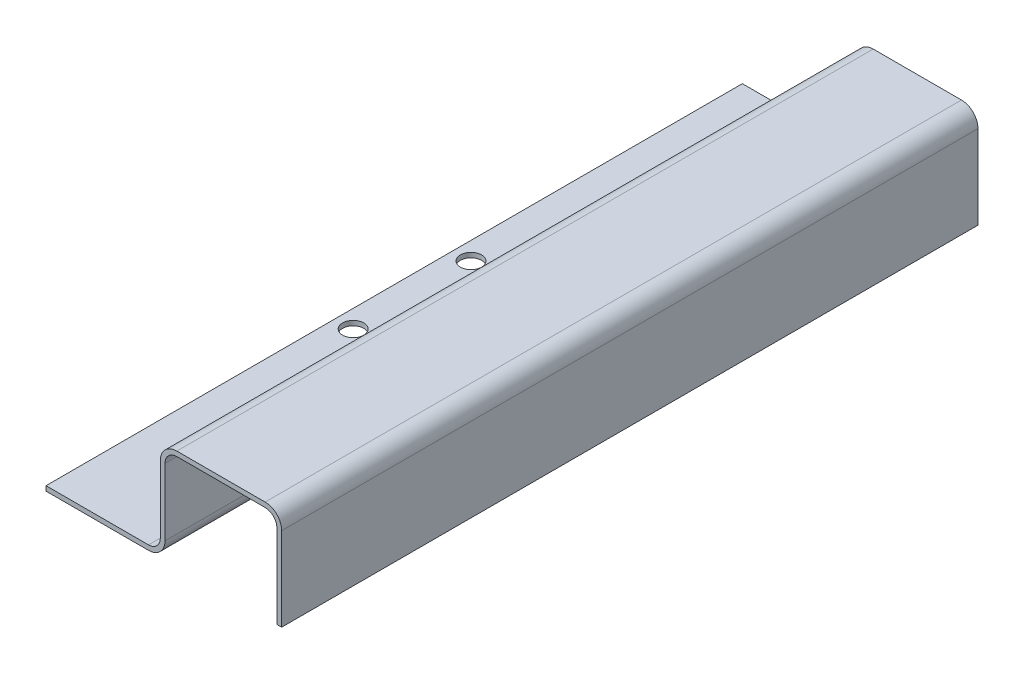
ISO-10303-21;
HEADER;
FILE_DESCRIPTION(('STEP AP214'),'2;1');
FILE_NAME('part.step','',(''),(''),'','','');
FILE_SCHEMA(('AUTOMOTIVE_DESIGN { 1 0 10303 214 1 1 1 1 }'));
ENDSEC;
DATA;
#1=APPLICATION_CONTEXT('core data for automotive mechanical design processes');
#2=APPLICATION_PROTOCOL_DEFINITION('international standard','automotive_design',2000,#1);
#3=PRODUCT_CONTEXT('',#1,'mechanical');
#4=PRODUCT('Part','Part','',(#3));
#5=PRODUCT_RELATED_PRODUCT_CATEGORY('part','',(#4));
#6=PRODUCT_DEFINITION_FORMATION('','',#4);
#7=PRODUCT_DEFINITION_CONTEXT('part definition',#1,'design');
#8=PRODUCT_DEFINITION('design','',#6,#7);
#9=PRODUCT_DEFINITION_SHAPE('','',#8);
#10=(LENGTH_UNIT() NAMED_UNIT(*) SI_UNIT(.MILLI.,.METRE.));
#11=(NAMED_UNIT(*) PLANE_ANGLE_UNIT() SI_UNIT($,.RADIAN.));
#12=(NAMED_UNIT(*) SI_UNIT($,.STERADIAN.) SOLID_ANGLE_UNIT());
#13=UNCERTAINTY_MEASURE_WITH_UNIT(LENGTH_MEASURE(1.E-05),#10,'distance_accuracy_value','');
#14=(GEOMETRIC_REPRESENTATION_CONTEXT(3) GLOBAL_UNCERTAINTY_ASSIGNED_CONTEXT((#13)) GLOBAL_UNIT_ASSIGNED_CONTEXT((#10,
#11,#12)) REPRESENTATION_CONTEXT('',''));
#15=CARTESIAN_POINT('',(0.,0.,0.));
#16=DIRECTION('',(0.,0.,1.));
#17=DIRECTION('',(1.,0.,0.));
#18=AXIS2_PLACEMENT_3D('',#15,#16,#17);
#19=CARTESIAN_POINT('',(47.23638,17.00276,75.057));
#20=DIRECTION('',(0.,0.,-1.));
#21=DIRECTION('',(-1.,0.,0.));
#22=AXIS2_PLACEMENT_3D('',#19,#20,#21);
#23=CYLINDRICAL_SURFACE('',#22,2.54);
#24=CARTESIAN_POINT('',(47.23638,17.00276,-75.057));
#25=DIRECTION('',(0.,0.,-1.));
#26=DIRECTION('',(1.,0.,0.));
#27=AXIS2_PLACEMENT_3D('',#24,#25,#26);
#28=CIRCLE('',#27,2.54);
#29=CARTESIAN_POINT('',(47.23638,19.54276,-75.057));
#30=VERTEX_POINT('',#29);
#31=CARTESIAN_POINT('',(49.77638,17.00276,-75.057));
#32=VERTEX_POINT('',#31);
#33=EDGE_CURVE('E179',#30,#32,#28,.T.);
#34=ORIENTED_EDGE('',*,*,#33,.T.);
#35=DIRECTION('',(0.,0.,-1.));
#36=VECTOR('',#35,1.);
#37=CARTESIAN_POINT('',(49.77638,17.00276,75.057));
#38=LINE('',#37,#36);
#39=CARTESIAN_POINT('',(49.77638,17.00276,75.057));
#40=VERTEX_POINT('',#39);
#41=EDGE_CURVE('E11',#40,#32,#38,.T.);
#42=ORIENTED_EDGE('',*,*,#41,.F.);
#43=CARTESIAN_POINT('',(47.23638,17.00276,75.057));
#44=DIRECTION('',(0.,0.,-1.));
#45=DIRECTION('',(1.,0.,0.));
#46=AXIS2_PLACEMENT_3D('',#43,#44,#45);
#47=CIRCLE('',#46,2.54);
#48=CARTESIAN_POINT('',(47.23638,19.54276,75.057));
#49=VERTEX_POINT('',#48);
#50=EDGE_CURVE('E210',#49,#40,#47,.T.);
#51=ORIENTED_EDGE('',*,*,#50,.F.);
#52=DIRECTION('',(0.,0.,-1.));
#53=VECTOR('',#52,1.);
#54=CARTESIAN_POINT('',(47.23638,19.54276,75.057));
#55=LINE('',#54,#53);
#56=EDGE_CURVE('E175',#49,#30,#55,.T.);
#57=ORIENTED_EDGE('',*,*,#56,.T.);
#58=EDGE_LOOP('',(#34,#42,#51,#57));
#59=FACE_BOUND('',#58,.T.);
#60=ADVANCED_FACE('F35',(#59),#23,.F.);
#61=CARTESIAN_POINT('',(49.77638,17.00276,75.057));
#62=DIRECTION('',(1.,0.,0.));
#63=DIRECTION('',(0.,1.,0.));
#64=AXIS2_PLACEMENT_3D('',#61,#62,#63);
#65=PLANE('',#64);
#66=DIRECTION('',(0.,-1.,0.));
#67=VECTOR('',#66,1.);
#68=CARTESIAN_POINT('',(49.77638,17.00276,-75.057));
#69=LINE('',#68,#67);
#70=CARTESIAN_POINT('',(49.77638,-1.02362,-75.057));
#71=VERTEX_POINT('',#70);
#72=EDGE_CURVE('E182',#32,#71,#69,.T.);
#73=ORIENTED_EDGE('',*,*,#72,.T.);
#74=DIRECTION('',(0.,0.,-1.));
#75=VECTOR('',#74,1.);
#76=CARTESIAN_POINT('',(49.77638,-1.02362,75.057));
#77=LINE('',#76,#75);
#78=CARTESIAN_POINT('',(49.77638,-1.02362,75.057));
#79=VERTEX_POINT('',#78);
#80=EDGE_CURVE('E43',#79,#71,#77,.T.);
#81=ORIENTED_EDGE('',*,*,#80,.F.);
#82=DIRECTION('',(0.,-1.,0.));
#83=VECTOR('',#82,1.);
#84=CARTESIAN_POINT('',(49.77638,17.00276,75.057));
#85=LINE('',#84,#83);
#86=EDGE_CURVE('E118',#40,#79,#85,.T.);
#87=ORIENTED_EDGE('',*,*,#86,.F.);
#88=ORIENTED_EDGE('',*,*,#41,.T.);
#89=EDGE_LOOP('',(#73,#81,#87,#88));
#90=FACE_BOUND('',#89,.T.);
#91=ADVANCED_FACE('F308',(#90),#65,.F.);
#92=CARTESIAN_POINT('',(49.77638,-1.02362,75.057));
#93=DIRECTION('',(0.,1.,0.));
#94=DIRECTION('',(0.,0.,1.));
#95=AXIS2_PLACEMENT_3D('',#92,#93,#94);
#96=PLANE('',#95);
#97=DIRECTION('',(1.,0.,0.));
#98=VECTOR('',#97,1.);
#99=CARTESIAN_POINT('',(49.77638,-1.02362,-75.057));
#100=LINE('',#99,#98);
#101=CARTESIAN_POINT('',(50.8,-1.02362,-75.057));
#102=VERTEX_POINT('',#101);
#103=EDGE_CURVE('E185',#71,#102,#100,.T.);
#104=ORIENTED_EDGE('',*,*,#103,.T.);
#105=DIRECTION('',(0.,0.,-1.));
#106=VECTOR('',#105,1.);
#107=CARTESIAN_POINT('',(50.8,-1.02362,75.057));
#108=LINE('',#107,#106);
#109=CARTESIAN_POINT('',(50.8,-1.02362,75.057));
#110=VERTEX_POINT('',#109);
#111=EDGE_CURVE('E241',#110,#102,#108,.T.);
#112=ORIENTED_EDGE('',*,*,#111,.F.);
#113=DIRECTION('',(1.,0.,0.));
#114=VECTOR('',#113,1.);
#115=CARTESIAN_POINT('',(49.77638,-1.02362,75.057));
#116=LINE('',#115,#114);
#117=EDGE_CURVE('E249',#79,#110,#116,.T.);
#118=ORIENTED_EDGE('',*,*,#117,.F.);
#119=ORIENTED_EDGE('',*,*,#80,.T.);
#120=EDGE_LOOP('',(#104,#112,#118,#119));
#121=FACE_BOUND('',#120,.T.);
#122=ADVANCED_FACE('F247',(#121),#96,.F.);
#123=CARTESIAN_POINT('',(50.8,17.00276,75.057));
#124=DIRECTION('',(-1.,0.,0.));
#125=DIRECTION('',(0.,-1.,0.));
#126=AXIS2_PLACEMENT_3D('',#123,#124,#125);
#127=PLANE('',#126);
#128=DIRECTION('',(0.,1.,0.));
#129=VECTOR('',#128,1.);
#130=CARTESIAN_POINT('',(50.8,17.00276,-75.057));
#131=LINE('',#130,#129);
#132=CARTESIAN_POINT('',(50.8,17.00276,-75.057));
#133=VERTEX_POINT('',#132);
#134=EDGE_CURVE('E187',#102,#133,#131,.T.);
#135=ORIENTED_EDGE('',*,*,#134,.T.);
#136=DIRECTION('',(0.,0.,-1.));
#137=VECTOR('',#136,1.);
#138=CARTESIAN_POINT('',(50.8,17.00276,75.057));
#139=LINE('',#138,#137);
#140=CARTESIAN_POINT('',(50.8,17.00276,75.057));
#141=VERTEX_POINT('',#140);
#142=EDGE_CURVE('E238',#141,#133,#139,.T.);
#143=ORIENTED_EDGE('',*,*,#142,.F.);
#144=DIRECTION('',(0.,1.,0.));
#145=VECTOR('',#144,1.);
#146=CARTESIAN_POINT('',(50.8,17.00276,75.057));
#147=LINE('',#146,#145);
#148=EDGE_CURVE('E267',#110,#141,#147,.T.);
#149=ORIENTED_EDGE('',*,*,#148,.F.);
#150=ORIENTED_EDGE('',*,*,#111,.T.);
#151=EDGE_LOOP('',(#135,#143,#149,#150));
#152=FACE_BOUND('',#151,.T.);
#153=ADVANCED_FACE('F258',(#152),#127,.F.);
#154=CARTESIAN_POINT('',(47.23638,17.00276,75.057));
#155=DIRECTION('',(0.,0.,-1.));
#156=DIRECTION('',(-1.,0.,0.));
#157=AXIS2_PLACEMENT_3D('',#154,#155,#156);
#158=CYLINDRICAL_SURFACE('',#157,3.56362);
#159=CARTESIAN_POINT('',(47.23638,17.00276,-75.057));
#160=DIRECTION('',(0.,0.,1.));
#161=DIRECTION('',(1.,0.,0.));
#162=AXIS2_PLACEMENT_3D('',#159,#160,#161);
#163=CIRCLE('',#162,3.56362);
#164=CARTESIAN_POINT('',(47.23638,20.56638,-75.057));
#165=VERTEX_POINT('',#164);
#166=EDGE_CURVE('E189',#133,#165,#163,.T.);
#167=ORIENTED_EDGE('',*,*,#166,.T.);
#168=DIRECTION('',(0.,0.,-1.));
#169=VECTOR('',#168,1.);
#170=CARTESIAN_POINT('',(47.23638,20.56638,75.057));
#171=LINE('',#170,#169);
#172=CARTESIAN_POINT('',(47.23638,20.56638,75.057));
#173=VERTEX_POINT('',#172);
#174=EDGE_CURVE('E235',#173,#165,#171,.T.);
#175=ORIENTED_EDGE('',*,*,#174,.F.);
#176=CARTESIAN_POINT('',(47.23638,17.00276,75.057));
#177=DIRECTION('',(0.,0.,1.));
#178=DIRECTION('',(1.,0.,0.));
#179=AXIS2_PLACEMENT_3D('',#176,#177,#178);
#180=CIRCLE('',#179,3.56362);
#181=EDGE_CURVE('E264',#141,#173,#180,.T.);
#182=ORIENTED_EDGE('',*,*,#181,.F.);
#183=ORIENTED_EDGE('',*,*,#142,.T.);
#184=EDGE_LOOP('',(#167,#175,#182,#183));
#185=FACE_BOUND('',#184,.T.);
#186=ADVANCED_FACE('F262',(#185),#158,.T.);
#187=CARTESIAN_POINT('',(28.20162,20.56638,75.057));
#188=DIRECTION('',(0.,-1.,0.));
#189=DIRECTION('',(0.,0.,-1.));
#190=AXIS2_PLACEMENT_3D('',#187,#188,#189);
#191=PLANE('',#190);
#192=DIRECTION('',(-1.,0.,0.));
#193=VECTOR('',#192,1.);
#194=CARTESIAN_POINT('',(28.20162,20.56638,-75.057));
#195=LINE('',#194,#193);
#196=CARTESIAN_POINT('',(28.20162,20.56638,-75.057));
#197=VERTEX_POINT('',#196);
#198=EDGE_CURVE('E191',#165,#197,#195,.T.);
#199=ORIENTED_EDGE('',*,*,#198,.T.);
#200=DIRECTION('',(0.,0.,-1.));
#201=VECTOR('',#200,1.);
#202=CARTESIAN_POINT('',(28.20162,20.56638,75.057));
#203=LINE('',#202,#201);
#204=CARTESIAN_POINT('',(28.20162,20.56638,75.057));
#205=VERTEX_POINT('',#204);
#206=EDGE_CURVE('E232',#205,#197,#203,.T.);
#207=ORIENTED_EDGE('',*,*,#206,.F.);
#208=DIRECTION('',(-1.,0.,0.));
#209=VECTOR('',#208,1.);
#210=CARTESIAN_POINT('',(28.20162,20.56638,75.057));
#211=LINE('',#210,#209);
#212=EDGE_CURVE('E266',#173,#205,#211,.T.);
#213=ORIENTED_EDGE('',*,*,#212,.F.);
#214=ORIENTED_EDGE('',*,*,#174,.T.);
#215=EDGE_LOOP('',(#199,#207,#213,#214));
#216=FACE_BOUND('',#215,.T.);
#217=ADVANCED_FACE('F321',(#216),#191,.F.);
#218=CARTESIAN_POINT('',(28.20162,17.00276,75.057));
#219=DIRECTION('',(0.,0.,-1.));
#220=DIRECTION('',(-1.,0.,0.));
#221=AXIS2_PLACEMENT_3D('',#218,#219,#220);
#222=CYLINDRICAL_SURFACE('',#221,3.56362);
#223=CARTESIAN_POINT('',(28.20162,17.00276,-75.057));
#224=DIRECTION('',(0.,0.,1.));
#225=DIRECTION('',(1.,0.,0.));
#226=AXIS2_PLACEMENT_3D('',#223,#224,#225);
#227=CIRCLE('',#226,3.56362);
#228=CARTESIAN_POINT('',(24.638,17.00276,-75.057));
#229=VERTEX_POINT('',#228);
#230=EDGE_CURVE('E193',#197,#229,#227,.T.);
#231=ORIENTED_EDGE('',*,*,#230,.T.);
#232=DIRECTION('',(0.,0.,-1.));
#233=VECTOR('',#232,1.);
#234=CARTESIAN_POINT('',(24.638,17.00276,75.057));
#235=LINE('',#234,#233);
#236=CARTESIAN_POINT('',(24.638,17.00276,75.057));
#237=VERTEX_POINT('',#236);
#238=EDGE_CURVE('E229',#237,#229,#235,.T.);
#239=ORIENTED_EDGE('',*,*,#238,.F.);
#240=CARTESIAN_POINT('',(28.20162,17.00276,75.057));
#241=DIRECTION('',(0.,0.,1.));
#242=DIRECTION('',(1.,0.,0.));
#243=AXIS2_PLACEMENT_3D('',#240,#241,#242);
#244=CIRCLE('',#243,3.56362);
#245=EDGE_CURVE('E269',#205,#237,#244,.T.);
#246=ORIENTED_EDGE('',*,*,#245,.F.);
#247=ORIENTED_EDGE('',*,*,#206,.T.);
#248=EDGE_LOOP('',(#231,#239,#246,#247));
#249=FACE_BOUND('',#248,.T.);
#250=ADVANCED_FACE('F324',(#249),#222,.T.);
#251=CARTESIAN_POINT('',(24.638,2.54,75.057));
#252=DIRECTION('',(1.,0.,0.));
#253=DIRECTION('',(0.,1.,0.));
#254=AXIS2_PLACEMENT_3D('',#251,#252,#253);
#255=PLANE('',#254);
#256=DIRECTION('',(0.,-1.,0.));
#257=VECTOR('',#256,1.);
#258=CARTESIAN_POINT('',(24.638,2.54,-75.057));
#259=LINE('',#258,#257);
#260=CARTESIAN_POINT('',(24.638,2.54,-75.057));
#261=VERTEX_POINT('',#260);
#262=EDGE_CURVE('E195',#229,#261,#259,.T.);
#263=ORIENTED_EDGE('',*,*,#262,.T.);
#264=DIRECTION('',(0.,0.,-1.));
#265=VECTOR('',#264,1.);
#266=CARTESIAN_POINT('',(24.638,2.54,75.057));
#267=LINE('',#266,#265);
#268=CARTESIAN_POINT('',(24.638,2.54,75.057));
#269=VERTEX_POINT('',#268);
#270=EDGE_CURVE('E226',#269,#261,#267,.T.);
#271=ORIENTED_EDGE('',*,*,#270,.F.);
#272=DIRECTION('',(0.,-1.,0.));
#273=VECTOR('',#272,1.);
#274=CARTESIAN_POINT('',(24.638,2.54,75.057));
#275=LINE('',#274,#273);
#276=EDGE_CURVE('E275',#237,#269,#275,.T.);
#277=ORIENTED_EDGE('',*,*,#276,.F.);
#278=ORIENTED_EDGE('',*,*,#238,.T.);
#279=EDGE_LOOP('',(#263,#271,#277,#278));
#280=FACE_BOUND('',#279,.T.);
#281=ADVANCED_FACE('F328',(#280),#255,.F.);
#282=CARTESIAN_POINT('',(22.098,2.54,75.057));
#283=DIRECTION('',(0.,0.,-1.));
#284=DIRECTION('',(-1.,0.,0.));
#285=AXIS2_PLACEMENT_3D('',#282,#283,#284);
#286=CYLINDRICAL_SURFACE('',#285,2.54);
#287=CARTESIAN_POINT('',(22.098,2.54,-75.057));
#288=DIRECTION('',(0.,0.,-1.));
#289=DIRECTION('',(1.,0.,0.));
#290=AXIS2_PLACEMENT_3D('',#287,#288,#289);
#291=CIRCLE('',#290,2.54);
#292=CARTESIAN_POINT('',(22.098,0.,-75.057));
#293=VERTEX_POINT('',#292);
#294=EDGE_CURVE('E197',#261,#293,#291,.T.);
#295=ORIENTED_EDGE('',*,*,#294,.T.);
#296=DIRECTION('',(0.,0.,-1.));
#297=VECTOR('',#296,1.);
#298=CARTESIAN_POINT('',(22.098,0.,75.057));
#299=LINE('',#298,#297);
#300=CARTESIAN_POINT('',(22.098,0.,75.057));
#301=VERTEX_POINT('',#300);
#302=EDGE_CURVE('E223',#301,#293,#299,.T.);
#303=ORIENTED_EDGE('',*,*,#302,.F.);
#304=CARTESIAN_POINT('',(22.098,2.54,75.057));
#305=DIRECTION('',(0.,0.,-1.));
#306=DIRECTION('',(1.,0.,0.));
#307=AXIS2_PLACEMENT_3D('',#304,#305,#306);
#308=CIRCLE('',#307,2.54);
#309=EDGE_CURVE('E277',#269,#301,#308,.T.);
#310=ORIENTED_EDGE('',*,*,#309,.F.);
#311=ORIENTED_EDGE('',*,*,#270,.T.);
#312=EDGE_LOOP('',(#295,#303,#310,#311));
#313=FACE_BOUND('',#312,.T.);
#314=ADVANCED_FACE('F332',(#313),#286,.F.);
#315=CARTESIAN_POINT('',(0.,0.,75.057));
#316=DIRECTION('',(0.,-1.,0.));
#317=DIRECTION('',(0.,0.,-1.));
#318=AXIS2_PLACEMENT_3D('',#315,#316,#317);
#319=PLANE('',#318);
#320=CARTESIAN_POINT('',(3.8608,0.,12.7));
#321=DIRECTION('',(0.,1.,0.));
#322=DIRECTION('',(0.,0.,1.));
#323=AXIS2_PLACEMENT_3D('',#320,#321,#322);
#324=CIRCLE('',#323,2.286);
#325=CARTESIAN_POINT('',(3.8608,0.,14.986));
#326=VERTEX_POINT('',#325);
#327=EDGE_CURVE('E421',#326,#326,#324,.T.);
#328=ORIENTED_EDGE('',*,*,#327,.F.);
#329=EDGE_LOOP('',(#328));
#330=FACE_BOUND('',#329,.T.);
#331=CARTESIAN_POINT('',(3.8608,0.,-12.7));
#332=DIRECTION('',(0.,1.,0.));
#333=DIRECTION('',(0.,0.,1.));
#334=AXIS2_PLACEMENT_3D('',#331,#332,#333);
#335=CIRCLE('',#334,2.286);
#336=CARTESIAN_POINT('',(3.8608,0.,-10.414));
#337=VERTEX_POINT('',#336);
#338=EDGE_CURVE('E423',#337,#337,#335,.T.);
#339=ORIENTED_EDGE('',*,*,#338,.F.);
#340=EDGE_LOOP('',(#339));
#341=FACE_BOUND('',#340,.T.);
#342=DIRECTION('',(-1.,0.,0.));
#343=VECTOR('',#342,1.);
#344=CARTESIAN_POINT('',(0.,0.,-75.057));
#345=LINE('',#344,#343);
#346=CARTESIAN_POINT('',(0.,0.,-75.057));
#347=VERTEX_POINT('',#346);
#348=EDGE_CURVE('E199',#293,#347,#345,.T.);
#349=ORIENTED_EDGE('',*,*,#348,.T.);
#350=DIRECTION('',(0.,0.,-1.));
#351=VECTOR('',#350,1.);
#352=CARTESIAN_POINT('',(0.,0.,75.057));
#353=LINE('',#352,#351);
#354=CARTESIAN_POINT('',(0.,0.,75.057));
#355=VERTEX_POINT('',#354);
#356=EDGE_CURVE('E220',#355,#347,#353,.T.);
#357=ORIENTED_EDGE('',*,*,#356,.F.);
#358=DIRECTION('',(-1.,0.,0.));
#359=VECTOR('',#358,1.);
#360=CARTESIAN_POINT('',(0.,0.,75.057));
#361=LINE('',#360,#359);
#362=EDGE_CURVE('E279',#301,#355,#361,.T.);
#363=ORIENTED_EDGE('',*,*,#362,.F.);
#364=ORIENTED_EDGE('',*,*,#302,.T.);
#365=EDGE_LOOP('',(#349,#357,#363,#364));
#366=FACE_BOUND('',#365,.T.);
#367=ADVANCED_FACE('F336',(#330,#341,#366),#319,.F.);
#368=CARTESIAN_POINT('',(0.,0.,75.057));
#369=DIRECTION('',(1.,0.,0.));
#370=DIRECTION('',(0.,1.,0.));
#371=AXIS2_PLACEMENT_3D('',#368,#369,#370);
#372=PLANE('',#371);
#373=DIRECTION('',(0.,-1.,0.));
#374=VECTOR('',#373,1.);
#375=CARTESIAN_POINT('',(0.,0.,-75.057));
#376=LINE('',#375,#374);
#377=CARTESIAN_POINT('',(0.,-1.02362,-75.057));
#378=VERTEX_POINT('',#377);
#379=EDGE_CURVE('E201',#347,#378,#376,.T.);
#380=ORIENTED_EDGE('',*,*,#379,.T.);
#381=DIRECTION('',(0.,0.,-1.));
#382=VECTOR('',#381,1.);
#383=CARTESIAN_POINT('',(0.,-1.02362,75.057));
#384=LINE('',#383,#382);
#385=CARTESIAN_POINT('',(0.,-1.02362,75.057));
#386=VERTEX_POINT('',#385);
#387=EDGE_CURVE('E217',#386,#378,#384,.T.);
#388=ORIENTED_EDGE('',*,*,#387,.F.);
#389=DIRECTION('',(0.,-1.,0.));
#390=VECTOR('',#389,1.);
#391=CARTESIAN_POINT('',(0.,0.,75.057));
#392=LINE('',#391,#390);
#393=EDGE_CURVE('E281',#355,#386,#392,.T.);
#394=ORIENTED_EDGE('',*,*,#393,.F.);
#395=ORIENTED_EDGE('',*,*,#356,.T.);
#396=EDGE_LOOP('',(#380,#388,#394,#395));
#397=FACE_BOUND('',#396,.T.);
#398=ADVANCED_FACE('F340',(#397),#372,.F.);
#399=CARTESIAN_POINT('',(0.,-1.02362,75.057));
#400=DIRECTION('',(0.,1.,0.));
#401=DIRECTION('',(0.,0.,1.));
#402=AXIS2_PLACEMENT_3D('',#399,#400,#401);
#403=PLANE('',#402);
#404=CARTESIAN_POINT('',(3.8608,-1.02362,12.7));
#405=DIRECTION('',(0.,1.,0.));
#406=DIRECTION('',(0.,0.,1.));
#407=AXIS2_PLACEMENT_3D('',#404,#405,#406);
#408=CIRCLE('',#407,2.286);
#409=CARTESIAN_POINT('',(3.8608,-1.02362,14.986));
#410=VERTEX_POINT('',#409);
#411=EDGE_CURVE('E418',#410,#410,#408,.T.);
#412=ORIENTED_EDGE('',*,*,#411,.T.);
#413=EDGE_LOOP('',(#412));
#414=FACE_BOUND('',#413,.T.);
#415=CARTESIAN_POINT('',(3.8608,-1.02362,-12.7));
#416=DIRECTION('',(0.,1.,0.));
#417=DIRECTION('',(0.,0.,1.));
#418=AXIS2_PLACEMENT_3D('',#415,#416,#417);
#419=CIRCLE('',#418,2.286);
#420=CARTESIAN_POINT('',(3.8608,-1.02362,-10.414));
#421=VERTEX_POINT('',#420);
#422=EDGE_CURVE('E183',#421,#421,#419,.T.);
#423=ORIENTED_EDGE('',*,*,#422,.T.);
#424=EDGE_LOOP('',(#423));
#425=FACE_BOUND('',#424,.T.);
#426=DIRECTION('',(1.,0.,0.));
#427=VECTOR('',#426,1.);
#428=CARTESIAN_POINT('',(0.,-1.02362,-75.057));
#429=LINE('',#428,#427);
#430=CARTESIAN_POINT('',(22.098,-1.02362,-75.057));
#431=VERTEX_POINT('',#430);
#432=EDGE_CURVE('E203',#378,#431,#429,.T.);
#433=ORIENTED_EDGE('',*,*,#432,.T.);
#434=DIRECTION('',(0.,0.,-1.));
#435=VECTOR('',#434,1.);
#436=CARTESIAN_POINT('',(22.098,-1.02362,75.057));
#437=LINE('',#436,#435);
#438=CARTESIAN_POINT('',(22.098,-1.02362,75.057));
#439=VERTEX_POINT('',#438);
#440=EDGE_CURVE('E214',#439,#431,#437,.T.);
#441=ORIENTED_EDGE('',*,*,#440,.F.);
#442=DIRECTION('',(1.,0.,0.));
#443=VECTOR('',#442,1.);
#444=CARTESIAN_POINT('',(0.,-1.02362,75.057));
#445=LINE('',#444,#443);
#446=EDGE_CURVE('E283',#386,#439,#445,.T.);
#447=ORIENTED_EDGE('',*,*,#446,.F.);
#448=ORIENTED_EDGE('',*,*,#387,.T.);
#449=EDGE_LOOP('',(#433,#441,#447,#448));
#450=FACE_BOUND('',#449,.T.);
#451=ADVANCED_FACE('F289',(#414,#425,#450),#403,.F.);
#452=CARTESIAN_POINT('',(22.098,2.54,75.057));
#453=DIRECTION('',(0.,0.,-1.));
#454=DIRECTION('',(-1.,0.,0.));
#455=AXIS2_PLACEMENT_3D('',#452,#453,#454);
#456=CYLINDRICAL_SURFACE('',#455,3.56361999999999);
#457=CARTESIAN_POINT('',(22.098,2.54,-75.057));
#458=DIRECTION('',(0.,0.,1.));
#459=DIRECTION('',(1.,0.,0.));
#460=AXIS2_PLACEMENT_3D('',#457,#458,#459);
#461=CIRCLE('',#460,3.56361999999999);
#462=CARTESIAN_POINT('',(25.66162,2.54,-75.057));
#463=VERTEX_POINT('',#462);
#464=EDGE_CURVE('E205',#431,#463,#461,.T.);
#465=ORIENTED_EDGE('',*,*,#464,.T.);
#466=DIRECTION('',(0.,0.,-1.));
#467=VECTOR('',#466,1.);
#468=CARTESIAN_POINT('',(25.66162,2.54,75.057));
#469=LINE('',#468,#467);
#470=CARTESIAN_POINT('',(25.66162,2.54,75.057));
#471=VERTEX_POINT('',#470);
#472=EDGE_CURVE('E170',#471,#463,#469,.T.);
#473=ORIENTED_EDGE('',*,*,#472,.F.);
#474=CARTESIAN_POINT('',(22.098,2.54,75.057));
#475=DIRECTION('',(0.,0.,1.));
#476=DIRECTION('',(1.,0.,0.));
#477=AXIS2_PLACEMENT_3D('',#474,#475,#476);
#478=CIRCLE('',#477,3.56361999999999);
#479=EDGE_CURVE('E161',#439,#471,#478,.T.);
#480=ORIENTED_EDGE('',*,*,#479,.F.);
#481=ORIENTED_EDGE('',*,*,#440,.T.);
#482=EDGE_LOOP('',(#465,#473,#480,#481));
#483=FACE_BOUND('',#482,.T.);
#484=ADVANCED_FACE('F293',(#483),#456,.T.);
#485=CARTESIAN_POINT('',(25.66162,2.54,75.057));
#486=DIRECTION('',(-1.,0.,0.));
#487=DIRECTION('',(0.,-1.,0.));
#488=AXIS2_PLACEMENT_3D('',#485,#486,#487);
#489=PLANE('',#488);
#490=DIRECTION('',(0.,1.,0.));
#491=VECTOR('',#490,1.);
#492=CARTESIAN_POINT('',(25.66162,2.54,-75.057));
#493=LINE('',#492,#491);
#494=CARTESIAN_POINT('',(25.66162,17.00276,-75.057));
#495=VERTEX_POINT('',#494);
#496=EDGE_CURVE('E169',#463,#495,#493,.T.);
#497=ORIENTED_EDGE('',*,*,#496,.T.);
#498=DIRECTION('',(0.,0.,-1.));
#499=VECTOR('',#498,1.);
#500=CARTESIAN_POINT('',(25.66162,17.00276,75.057));
#501=LINE('',#500,#499);
#502=CARTESIAN_POINT('',(25.66162,17.00276,75.057));
#503=VERTEX_POINT('',#502);
#504=EDGE_CURVE('E166',#503,#495,#501,.T.);
#505=ORIENTED_EDGE('',*,*,#504,.F.);
#506=DIRECTION('',(0.,1.,0.));
#507=VECTOR('',#506,1.);
#508=CARTESIAN_POINT('',(25.66162,2.54,75.057));
#509=LINE('',#508,#507);
#510=EDGE_CURVE('E155',#471,#503,#509,.T.);
#511=ORIENTED_EDGE('',*,*,#510,.F.);
#512=ORIENTED_EDGE('',*,*,#472,.T.);
#513=EDGE_LOOP('',(#497,#505,#511,#512));
#514=FACE_BOUND('',#513,.T.);
#515=ADVANCED_FACE('F167',(#514),#489,.F.);
#516=CARTESIAN_POINT('',(28.20162,17.00276,75.057));
#517=DIRECTION('',(0.,0.,-1.));
#518=DIRECTION('',(-1.,0.,0.));
#519=AXIS2_PLACEMENT_3D('',#516,#517,#518);
#520=CYLINDRICAL_SURFACE('',#519,2.54);
#521=CARTESIAN_POINT('',(28.20162,17.00276,-75.057));
#522=DIRECTION('',(0.,0.,-1.));
#523=DIRECTION('',(1.,0.,0.));
#524=AXIS2_PLACEMENT_3D('',#521,#522,#523);
#525=CIRCLE('',#524,2.54);
#526=CARTESIAN_POINT('',(28.20162,19.54276,-75.057));
#527=VERTEX_POINT('',#526);
#528=EDGE_CURVE('E104',#495,#527,#525,.T.);
#529=ORIENTED_EDGE('',*,*,#528,.T.);
#530=DIRECTION('',(0.,0.,-1.));
#531=VECTOR('',#530,1.);
#532=CARTESIAN_POINT('',(28.20162,19.54276,75.057));
#533=LINE('',#532,#531);
#534=CARTESIAN_POINT('',(28.20162,19.54276,75.057));
#535=VERTEX_POINT('',#534);
#536=EDGE_CURVE('E171',#535,#527,#533,.T.);
#537=ORIENTED_EDGE('',*,*,#536,.F.);
#538=CARTESIAN_POINT('',(28.20162,17.00276,75.057));
#539=DIRECTION('',(0.,0.,-1.));
#540=DIRECTION('',(1.,0.,0.));
#541=AXIS2_PLACEMENT_3D('',#538,#539,#540);
#542=CIRCLE('',#541,2.54);
#543=EDGE_CURVE('E159',#503,#535,#542,.T.);
#544=ORIENTED_EDGE('',*,*,#543,.F.);
#545=ORIENTED_EDGE('',*,*,#504,.T.);
#546=EDGE_LOOP('',(#529,#537,#544,#545));
#547=FACE_BOUND('',#546,.T.);
#548=ADVANCED_FACE('F173',(#547),#520,.F.);
#549=CARTESIAN_POINT('',(28.20162,19.54276,75.057));
#550=DIRECTION('',(0.,1.,0.));
#551=DIRECTION('',(0.,0.,1.));
#552=AXIS2_PLACEMENT_3D('',#549,#550,#551);
#553=PLANE('',#552);
#554=DIRECTION('',(1.,0.,0.));
#555=VECTOR('',#554,1.);
#556=CARTESIAN_POINT('',(28.20162,19.54276,-75.057));
#557=LINE('',#556,#555);
#558=EDGE_CURVE('E110',#527,#30,#557,.T.);
#559=ORIENTED_EDGE('',*,*,#558,.T.);
#560=ORIENTED_EDGE('',*,*,#56,.F.);
#561=DIRECTION('',(1.,0.,0.));
#562=VECTOR('',#561,1.);
#563=CARTESIAN_POINT('',(28.20162,19.54276,75.057));
#564=LINE('',#563,#562);
#565=EDGE_CURVE('E51',#535,#49,#564,.T.);
#566=ORIENTED_EDGE('',*,*,#565,.F.);
#567=ORIENTED_EDGE('',*,*,#536,.T.);
#568=EDGE_LOOP('',(#559,#560,#566,#567));
#569=FACE_BOUND('',#568,.T.);
#570=ADVANCED_FACE('F297',(#569),#553,.F.);
#571=CARTESIAN_POINT('',(47.23638,17.00276,75.057));
#572=DIRECTION('',(0.,0.,1.));
#573=DIRECTION('',(1.,0.,0.));
#574=AXIS2_PLACEMENT_3D('',#571,#572,#573);
#575=PLANE('',#574);
#576=ORIENTED_EDGE('',*,*,#50,.T.);
#577=ORIENTED_EDGE('',*,*,#86,.T.);
#578=ORIENTED_EDGE('',*,*,#117,.T.);
#579=ORIENTED_EDGE('',*,*,#148,.T.);
#580=ORIENTED_EDGE('',*,*,#181,.T.);
#581=ORIENTED_EDGE('',*,*,#212,.T.);
#582=ORIENTED_EDGE('',*,*,#245,.T.);
#583=ORIENTED_EDGE('',*,*,#276,.T.);
#584=ORIENTED_EDGE('',*,*,#309,.T.);
#585=ORIENTED_EDGE('',*,*,#362,.T.);
#586=ORIENTED_EDGE('',*,*,#393,.T.);
#587=ORIENTED_EDGE('',*,*,#446,.T.);
#588=ORIENTED_EDGE('',*,*,#479,.T.);
#589=ORIENTED_EDGE('',*,*,#510,.T.);
#590=ORIENTED_EDGE('',*,*,#543,.T.);
#591=ORIENTED_EDGE('',*,*,#565,.T.);
#592=EDGE_LOOP('',(#576,#577,#578,#579,#580,#581,#582,#583,#584,#585,#586,#587,#588,#589,#590,#591));
#593=FACE_BOUND('',#592,.T.);
#594=ADVANCED_FACE('F157',(#593),#575,.T.);
#595=CARTESIAN_POINT('',(47.23638,17.00276,-75.057));
#596=DIRECTION('',(0.,0.,1.));
#597=DIRECTION('',(1.,0.,0.));
#598=AXIS2_PLACEMENT_3D('',#595,#596,#597);
#599=PLANE('',#598);
#600=ORIENTED_EDGE('',*,*,#33,.F.);
#601=ORIENTED_EDGE('',*,*,#558,.F.);
#602=ORIENTED_EDGE('',*,*,#528,.F.);
#603=ORIENTED_EDGE('',*,*,#496,.F.);
#604=ORIENTED_EDGE('',*,*,#464,.F.);
#605=ORIENTED_EDGE('',*,*,#432,.F.);
#606=ORIENTED_EDGE('',*,*,#379,.F.);
#607=ORIENTED_EDGE('',*,*,#348,.F.);
#608=ORIENTED_EDGE('',*,*,#294,.F.);
#609=ORIENTED_EDGE('',*,*,#262,.F.);
#610=ORIENTED_EDGE('',*,*,#230,.F.);
#611=ORIENTED_EDGE('',*,*,#198,.F.);
#612=ORIENTED_EDGE('',*,*,#166,.F.);
#613=ORIENTED_EDGE('',*,*,#134,.F.);
#614=ORIENTED_EDGE('',*,*,#103,.F.);
#615=ORIENTED_EDGE('',*,*,#72,.F.);
#616=EDGE_LOOP('',(#600,#601,#602,#603,#604,#605,#606,#607,#608,#609,#610,#611,#612,#613,#614,#615));
#617=FACE_BOUND('',#616,.T.);
#618=ADVANCED_FACE('F253',(#617),#599,.F.);
#619=CARTESIAN_POINT('',(3.8608,0.,-12.7));
#620=DIRECTION('',(0.,1.,0.));
#621=DIRECTION('',(0.,0.,1.));
#622=AXIS2_PLACEMENT_3D('',#619,#620,#621);
#623=CYLINDRICAL_SURFACE('',#622,2.286);
#624=ORIENTED_EDGE('',*,*,#422,.F.);
#625=EDGE_LOOP('',(#624));
#626=FACE_BOUND('',#625,.T.);
#627=ORIENTED_EDGE('',*,*,#338,.T.);
#628=EDGE_LOOP('',(#627));
#629=FACE_BOUND('',#628,.T.);
#630=ADVANCED_FACE('F378',(#626,#629),#623,.F.);
#631=CARTESIAN_POINT('',(3.8608,0.,12.7));
#632=DIRECTION('',(0.,1.,0.));
#633=DIRECTION('',(0.,0.,1.));
#634=AXIS2_PLACEMENT_3D('',#631,#632,#633);
#635=CYLINDRICAL_SURFACE('',#634,2.286);
#636=ORIENTED_EDGE('',*,*,#411,.F.);
#637=EDGE_LOOP('',(#636));
#638=FACE_BOUND('',#637,.T.);
#639=ORIENTED_EDGE('',*,*,#327,.T.);
#640=EDGE_LOOP('',(#639));
#641=FACE_BOUND('',#640,.T.);
#642=ADVANCED_FACE('F401',(#638,#641),#635,.F.);
#643=CLOSED_SHELL('',(#60,#91,#122,#153,#186,#217,#250,#281,#314,#367,#398,#451,#484,#515,#548,
#570,#594,#618,#630,#642));
#644=MANIFOLD_SOLID_BREP('B2',#643);
#645=ADVANCED_BREP_SHAPE_REPRESENTATION('',(#18,#644),#14);
#646=SHAPE_DEFINITION_REPRESENTATION(#9,#645);
ENDSEC;
END-ISO-10303-21;
